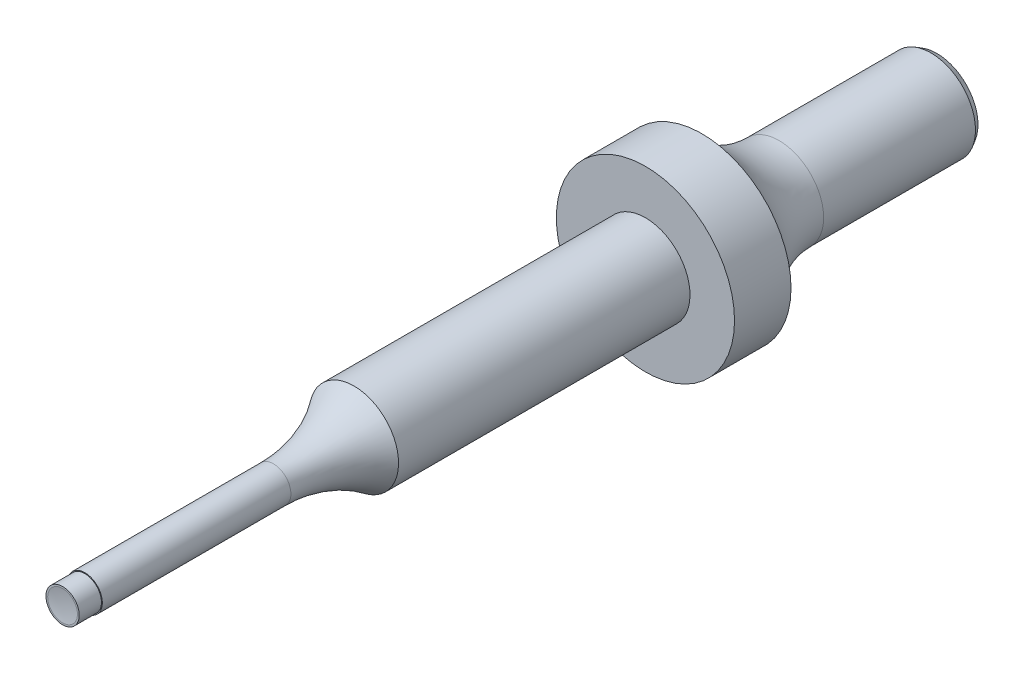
ISO-10303-21;
HEADER;
FILE_DESCRIPTION(('STEP AP214'),'2;1');
FILE_NAME('part.step','',(''),(''),'','','');
FILE_SCHEMA(('AUTOMOTIVE_DESIGN { 1 0 10303 214 1 1 1 1 }'));
ENDSEC;
DATA;
#1=APPLICATION_CONTEXT('core data for automotive mechanical design processes');
#2=APPLICATION_PROTOCOL_DEFINITION('international standard','automotive_design',2000,#1);
#3=PRODUCT_CONTEXT('',#1,'mechanical');
#4=PRODUCT('Part','Part','',(#3));
#5=PRODUCT_RELATED_PRODUCT_CATEGORY('part','',(#4));
#6=PRODUCT_DEFINITION_FORMATION('','',#4);
#7=PRODUCT_DEFINITION_CONTEXT('part definition',#1,'design');
#8=PRODUCT_DEFINITION('design','',#6,#7);
#9=PRODUCT_DEFINITION_SHAPE('','',#8);
#10=(LENGTH_UNIT() NAMED_UNIT(*) SI_UNIT(.MILLI.,.METRE.));
#11=(NAMED_UNIT(*) PLANE_ANGLE_UNIT() SI_UNIT($,.RADIAN.));
#12=(NAMED_UNIT(*) SI_UNIT($,.STERADIAN.) SOLID_ANGLE_UNIT());
#13=UNCERTAINTY_MEASURE_WITH_UNIT(LENGTH_MEASURE(1.E-05),#10,'distance_accuracy_value','');
#14=(GEOMETRIC_REPRESENTATION_CONTEXT(3) GLOBAL_UNCERTAINTY_ASSIGNED_CONTEXT((#13)) GLOBAL_UNIT_ASSIGNED_CONTEXT((#10,
#11,#12)) REPRESENTATION_CONTEXT('',''));
#15=CARTESIAN_POINT('',(0.,0.,0.));
#16=DIRECTION('',(0.,0.,1.));
#17=DIRECTION('',(1.,0.,0.));
#18=AXIS2_PLACEMENT_3D('',#15,#16,#17);
#19=CARTESIAN_POINT('',(0.,0.,-100.));
#20=DIRECTION('',(0.,0.,1.));
#21=DIRECTION('',(1.,0.,0.));
#22=AXIS2_PLACEMENT_3D('',#19,#20,#21);
#23=CYLINDRICAL_SURFACE('',#22,5.095);
#24=CARTESIAN_POINT('',(0.,0.,-33.3333333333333));
#25=DIRECTION('',(0.,0.,-1.));
#26=DIRECTION('',(0.,1.,0.));
#27=AXIS2_PLACEMENT_3D('',#24,#25,#26);
#28=CIRCLE('',#27,5.095);
#29=CARTESIAN_POINT('',(0.,5.095,-33.3333333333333));
#30=VERTEX_POINT('',#29);
#31=EDGE_CURVE('E77',#30,#30,#28,.T.);
#32=ORIENTED_EDGE('',*,*,#31,.T.);
#33=EDGE_LOOP('',(#32));
#34=FACE_BOUND('',#33,.T.);
#35=CARTESIAN_POINT('',(0.,0.,-66.6666666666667));
#36=DIRECTION('',(0.,0.,-1.));
#37=DIRECTION('',(-1.,0.,0.));
#38=AXIS2_PLACEMENT_3D('',#35,#36,#37);
#39=CIRCLE('',#38,5.095);
#40=CARTESIAN_POINT('',(-5.095,0.,-66.6666666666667));
#41=VERTEX_POINT('',#40);
#42=EDGE_CURVE('E44',#41,#41,#39,.F.);
#43=ORIENTED_EDGE('',*,*,#42,.T.);
#44=EDGE_LOOP('',(#43));
#45=FACE_BOUND('',#44,.T.);
#46=ADVANCED_FACE('F40',(#34,#45),#23,.T.);
#47=CARTESIAN_POINT('',(0.,0.,-33.3333333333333));
#48=DIRECTION('',(0.,0.,1.));
#49=DIRECTION('',(1.,0.,0.));
#50=AXIS2_PLACEMENT_3D('',#47,#48,#49);
#51=CYLINDRICAL_SURFACE('',#50,2.);
#52=CARTESIAN_POINT('',(0.,0.,-24.1118841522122));
#53=DIRECTION('',(0.,0.,1.));
#54=DIRECTION('',(0.,-1.,0.));
#55=AXIS2_PLACEMENT_3D('',#52,#53,#54);
#56=CIRCLE('',#55,2.);
#57=CARTESIAN_POINT('',(0.,-2.,-24.1118841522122));
#58=VERTEX_POINT('',#57);
#59=EDGE_CURVE('E12',#58,#58,#56,.F.);
#60=ORIENTED_EDGE('',*,*,#59,.F.);
#61=EDGE_LOOP('',(#60));
#62=FACE_BOUND('',#61,.T.);
#63=CARTESIAN_POINT('',(0.,0.,-2.5475));
#64=DIRECTION('',(0.,0.,1.));
#65=DIRECTION('',(1.,0.,0.));
#66=AXIS2_PLACEMENT_3D('',#63,#64,#65);
#67=CIRCLE('',#66,2.);
#68=CARTESIAN_POINT('',(2.,0.,-2.5475));
#69=VERTEX_POINT('',#68);
#70=EDGE_CURVE('E62',#69,#69,#67,.F.);
#71=ORIENTED_EDGE('',*,*,#70,.T.);
#72=EDGE_LOOP('',(#71));
#73=FACE_BOUND('',#72,.T.);
#74=ADVANCED_FACE('F106',(#62,#73),#51,.T.);
#75=CARTESIAN_POINT('',(0.,0.,-2.5475));
#76=DIRECTION('',(0.,0.,1.));
#77=DIRECTION('',(1.,0.,0.));
#78=AXIS2_PLACEMENT_3D('',#75,#76,#77);
#79=PLANE('',#78);
#80=ORIENTED_EDGE('',*,*,#70,.F.);
#81=EDGE_LOOP('',(#80));
#82=FACE_BOUND('',#81,.T.);
#83=CARTESIAN_POINT('',(0.,0.,-2.5475));
#84=DIRECTION('',(0.,0.,1.));
#85=DIRECTION('',(1.,0.,0.));
#86=AXIS2_PLACEMENT_3D('',#83,#84,#85);
#87=CIRCLE('',#86,1.9);
#88=CARTESIAN_POINT('',(1.9,0.,-2.5475));
#89=VERTEX_POINT('',#88);
#90=EDGE_CURVE('E66',#89,#89,#87,.T.);
#91=ORIENTED_EDGE('',*,*,#90,.F.);
#92=EDGE_LOOP('',(#91));
#93=FACE_BOUND('',#92,.T.);
#94=ADVANCED_FACE('F111',(#82,#93),#79,.T.);
#95=CARTESIAN_POINT('',(0.,0.,-2.5475));
#96=DIRECTION('',(0.,0.,1.));
#97=DIRECTION('',(1.,0.,0.));
#98=AXIS2_PLACEMENT_3D('',#95,#96,#97);
#99=CYLINDRICAL_SURFACE('',#98,1.9);
#100=CARTESIAN_POINT('',(0.,0.,0.));
#101=DIRECTION('',(0.,0.,1.));
#102=DIRECTION('',(1.,0.,0.));
#103=AXIS2_PLACEMENT_3D('',#100,#101,#102);
#104=CIRCLE('',#103,1.9);
#105=CARTESIAN_POINT('',(1.9,0.,0.));
#106=VERTEX_POINT('',#105);
#107=EDGE_CURVE('E67',#106,#106,#104,.T.);
#108=CARTESIAN_POINT('',(1.9,0.,-2.5475));
#109=CARTESIAN_POINT('',(1.9,0.,-2.52096354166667));
#110=CARTESIAN_POINT('',(1.9,0.,-2.49442708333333));
#111=CARTESIAN_POINT('',(1.9,0.,-2.44135416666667));
#112=CARTESIAN_POINT('',(1.9,0.,-2.41481770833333));
#113=CARTESIAN_POINT('',(1.9,0.,-2.36174479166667));
#114=CARTESIAN_POINT('',(1.9,0.,-2.33520833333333));
#115=CARTESIAN_POINT('',(1.9,0.,-2.28213541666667));
#116=CARTESIAN_POINT('',(1.9,0.,-2.25559895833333));
#117=CARTESIAN_POINT('',(1.9,0.,-2.20252604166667));
#118=CARTESIAN_POINT('',(1.9,0.,-2.17598958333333));
#119=CARTESIAN_POINT('',(1.9,0.,-2.12291666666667));
#120=CARTESIAN_POINT('',(1.9,0.,-2.09638020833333));
#121=CARTESIAN_POINT('',(1.9,0.,-2.04330729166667));
#122=CARTESIAN_POINT('',(1.9,0.,-2.01677083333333));
#123=CARTESIAN_POINT('',(1.9,0.,-1.96369791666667));
#124=CARTESIAN_POINT('',(1.9,0.,-1.93716145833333));
#125=CARTESIAN_POINT('',(1.9,0.,-1.88408854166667));
#126=CARTESIAN_POINT('',(1.9,0.,-1.85755208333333));
#127=CARTESIAN_POINT('',(1.9,0.,-1.80447916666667));
#128=CARTESIAN_POINT('',(1.9,0.,-1.77794270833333));
#129=CARTESIAN_POINT('',(1.9,0.,-1.72486979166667));
#130=CARTESIAN_POINT('',(1.9,0.,-1.69833333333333));
#131=CARTESIAN_POINT('',(1.9,0.,-1.64526041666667));
#132=CARTESIAN_POINT('',(1.9,0.,-1.61872395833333));
#133=CARTESIAN_POINT('',(1.9,0.,-1.56565104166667));
#134=CARTESIAN_POINT('',(1.9,0.,-1.53911458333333));
#135=CARTESIAN_POINT('',(1.9,0.,-1.48604166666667));
#136=CARTESIAN_POINT('',(1.9,0.,-1.45950520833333));
#137=CARTESIAN_POINT('',(1.9,0.,-1.40643229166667));
#138=CARTESIAN_POINT('',(1.9,0.,-1.37989583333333));
#139=CARTESIAN_POINT('',(1.9,0.,-1.32682291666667));
#140=CARTESIAN_POINT('',(1.9,0.,-1.30028645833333));
#141=CARTESIAN_POINT('',(1.9,0.,-1.24721354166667));
#142=CARTESIAN_POINT('',(1.9,0.,-1.22067708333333));
#143=CARTESIAN_POINT('',(1.9,0.,-1.16760416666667));
#144=CARTESIAN_POINT('',(1.9,0.,-1.14106770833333));
#145=CARTESIAN_POINT('',(1.9,0.,-1.08799479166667));
#146=CARTESIAN_POINT('',(1.9,0.,-1.06145833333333));
#147=CARTESIAN_POINT('',(1.9,0.,-1.00838541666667));
#148=CARTESIAN_POINT('',(1.9,0.,-0.981848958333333));
#149=CARTESIAN_POINT('',(1.9,0.,-0.928776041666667));
#150=CARTESIAN_POINT('',(1.9,0.,-0.902239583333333));
#151=CARTESIAN_POINT('',(1.9,0.,-0.849166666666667));
#152=CARTESIAN_POINT('',(1.9,0.,-0.822630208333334));
#153=CARTESIAN_POINT('',(1.9,0.,-0.769557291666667));
#154=CARTESIAN_POINT('',(1.9,0.,-0.743020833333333));
#155=CARTESIAN_POINT('',(1.9,0.,-0.689947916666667));
#156=CARTESIAN_POINT('',(1.9,0.,-0.663411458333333));
#157=CARTESIAN_POINT('',(1.9,0.,-0.610338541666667));
#158=CARTESIAN_POINT('',(1.9,0.,-0.583802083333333));
#159=CARTESIAN_POINT('',(1.9,0.,-0.530729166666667));
#160=CARTESIAN_POINT('',(1.9,0.,-0.504192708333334));
#161=CARTESIAN_POINT('',(1.9,0.,-0.451119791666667));
#162=CARTESIAN_POINT('',(1.9,0.,-0.424583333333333));
#163=CARTESIAN_POINT('',(1.9,0.,-0.371510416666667));
#164=CARTESIAN_POINT('',(1.9,0.,-0.344973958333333));
#165=CARTESIAN_POINT('',(1.9,0.,-0.291901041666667));
#166=CARTESIAN_POINT('',(1.9,0.,-0.265364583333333));
#167=CARTESIAN_POINT('',(1.9,0.,-0.212291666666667));
#168=CARTESIAN_POINT('',(1.9,0.,-0.185755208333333));
#169=CARTESIAN_POINT('',(1.9,0.,-0.132682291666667));
#170=CARTESIAN_POINT('',(1.9,0.,-0.106145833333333));
#171=CARTESIAN_POINT('',(1.9,0.,-0.0530729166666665));
#172=CARTESIAN_POINT('',(1.9,0.,-0.0265364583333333));
#173=CARTESIAN_POINT('',(1.9,0.,0.));
#174=B_SPLINE_CURVE_WITH_KNOTS('',3,(#108,#109,#110,#111,#112,#113,#114,#115,#116,#117,#118,
#119,#120,#121,#122,#123,#124,#125,#126,#127,#128,#129,#130,#131,#132,#133,#134,#135,#136,#137,
#138,#139,#140,#141,#142,#143,#144,#145,#146,#147,#148,#149,#150,#151,#152,#153,#154,#155,#156,
#157,#158,#159,#160,#161,#162,#163,#164,#165,#166,#167,#168,#169,#170,#171,#172,#173),
.UNSPECIFIED.,.F.,.F.,(4,2,2,2,2,2,2,2,2,2,2,2,2,2,2,2,2,2,2,2,2,2,2,2,2,2,2,2,2,2,2,2,4),(0.,
0.0796093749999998,0.15921875,0.238828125,0.3184375,0.398046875,0.47765625,0.557265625,0.636875,
0.716484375,0.79609375,0.875703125,0.9553125,1.034921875,1.11453125,1.194140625,1.27375,
1.353359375,1.43296875,1.512578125,1.5921875,1.671796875,1.75140625,1.831015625,1.910625,
1.990234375,2.06984375,2.149453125,2.2290625,2.308671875,2.38828125,2.467890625,2.5475),.UNSPECIFIED.);
#175=EDGE_CURVE('BSEAM147',#89,#106,#174,.T.);
#176=ORIENTED_EDGE('',*,*,#90,.T.);
#177=ORIENTED_EDGE('',*,*,#107,.F.);
#178=ORIENTED_EDGE('',*,*,#175,.T.);
#179=ORIENTED_EDGE('',*,*,#175,.F.);
#180=EDGE_LOOP('',(#176,#178,#177,#179));
#181=FACE_BOUND('',#180,.T.);
#182=ADVANCED_FACE('F147',(#181),#99,.T.);
#183=CARTESIAN_POINT('',(0.,0.,0.));
#184=DIRECTION('',(0.,0.,1.));
#185=DIRECTION('',(1.,0.,0.));
#186=AXIS2_PLACEMENT_3D('',#183,#184,#185);
#187=PLANE('',#186);
#188=CARTESIAN_POINT('',(0.,0.,0.));
#189=DIRECTION('',(0.,0.,1.));
#190=DIRECTION('',(0.,-1.,0.));
#191=AXIS2_PLACEMENT_3D('',#188,#189,#190);
#192=CIRCLE('',#191,1.7);
#193=CARTESIAN_POINT('',(0.,-1.7,0.));
#194=VERTEX_POINT('',#193);
#195=EDGE_CURVE('E71',#194,#194,#192,.T.);
#196=ORIENTED_EDGE('',*,*,#195,.F.);
#197=EDGE_LOOP('',(#196));
#198=FACE_BOUND('',#197,.T.);
#199=ORIENTED_EDGE('',*,*,#107,.T.);
#200=EDGE_LOOP('',(#199));
#201=FACE_BOUND('',#200,.T.);
#202=ADVANCED_FACE('F145',(#198,#201),#187,.T.);
#203=CARTESIAN_POINT('',(0.,0.,10.0471936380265));
#204=DIRECTION('',(0.,0.,1.));
#205=DIRECTION('',(0.,-1.,0.));
#206=AXIS2_PLACEMENT_3D('',#203,#204,#205);
#207=SPHERICAL_SURFACE('',#206,10.19);
#208=ORIENTED_EDGE('',*,*,#195,.T.);
#209=EDGE_LOOP('',(#208));
#210=FACE_BOUND('',#209,.T.);
#211=ADVANCED_FACE('F142',(#210),#207,.F.);
#212=CARTESIAN_POINT('',(0.,0.,-24.1118841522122));
#213=DIRECTION('',(0.,0.,-1.));
#214=DIRECTION('',(0.,1.,0.));
#215=AXIS2_PLACEMENT_3D('',#212,#213,#214);
#216=TOROIDAL_SURFACE('',#215,17.285,15.285);
#217=ORIENTED_EDGE('',*,*,#59,.T.);
#218=EDGE_LOOP('',(#217));
#219=FACE_BOUND('',#218,.T.);
#220=ORIENTED_EDGE('',*,*,#31,.F.);
#221=EDGE_LOOP('',(#220));
#222=FACE_BOUND('',#221,.T.);
#223=ADVANCED_FACE('F123',(#219,#222),#216,.F.);
#224=CARTESIAN_POINT('',(0.,0.,-66.6666666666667));
#225=DIRECTION('',(0.,0.,-1.));
#226=DIRECTION('',(-1.,0.,0.));
#227=AXIS2_PLACEMENT_3D('',#224,#225,#226);
#228=PLANE('',#227);
#229=ORIENTED_EDGE('',*,*,#42,.F.);
#230=EDGE_LOOP('',(#229));
#231=FACE_BOUND('',#230,.T.);
#232=CARTESIAN_POINT('',(0.,0.,-66.6666666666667));
#233=DIRECTION('',(0.,0.,1.));
#234=DIRECTION('',(1.,0.,0.));
#235=AXIS2_PLACEMENT_3D('',#232,#233,#234);
#236=CIRCLE('',#235,10.19);
#237=CARTESIAN_POINT('',(10.19,0.,-66.6666666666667));
#238=VERTEX_POINT('',#237);
#239=EDGE_CURVE('E81',#238,#238,#236,.T.);
#240=ORIENTED_EDGE('',*,*,#239,.T.);
#241=EDGE_LOOP('',(#240));
#242=FACE_BOUND('',#241,.T.);
#243=ADVANCED_FACE('F119',(#231,#242),#228,.F.);
#244=CARTESIAN_POINT('',(0.,0.,-66.6666666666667));
#245=DIRECTION('',(0.,0.,1.));
#246=DIRECTION('',(1.,0.,0.));
#247=AXIS2_PLACEMENT_3D('',#244,#245,#246);
#248=CYLINDRICAL_SURFACE('',#247,10.19);
#249=ORIENTED_EDGE('',*,*,#239,.F.);
#250=EDGE_LOOP('',(#249));
#251=FACE_BOUND('',#250,.T.);
#252=CARTESIAN_POINT('',(0.,0.,-73.1268678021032));
#253=DIRECTION('',(0.,0.,1.));
#254=DIRECTION('',(1.,0.,0.));
#255=AXIS2_PLACEMENT_3D('',#252,#253,#254);
#256=CIRCLE('',#255,10.19);
#257=CARTESIAN_POINT('',(10.19,0.,-73.1268678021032));
#258=VERTEX_POINT('',#257);
#259=EDGE_CURVE('E84',#258,#258,#256,.T.);
#260=ORIENTED_EDGE('',*,*,#259,.T.);
#261=EDGE_LOOP('',(#260));
#262=FACE_BOUND('',#261,.T.);
#263=ADVANCED_FACE('F122',(#251,#262),#248,.T.);
#264=CARTESIAN_POINT('',(0.,0.,-81.9516666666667));
#265=DIRECTION('',(0.,0.,1.));
#266=DIRECTION('',(1.,0.,0.));
#267=AXIS2_PLACEMENT_3D('',#264,#265,#266);
#268=TOROIDAL_SURFACE('',#267,15.285,10.19);
#269=ORIENTED_EDGE('',*,*,#259,.F.);
#270=EDGE_LOOP('',(#269));
#271=FACE_BOUND('',#270,.T.);
#272=CARTESIAN_POINT('',(0.,0.,-81.9516666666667));
#273=DIRECTION('',(0.,0.,1.));
#274=DIRECTION('',(1.,0.,0.));
#275=AXIS2_PLACEMENT_3D('',#272,#273,#274);
#276=CIRCLE('',#275,5.095);
#277=CARTESIAN_POINT('',(5.095,0.,-81.9516666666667));
#278=VERTEX_POINT('',#277);
#279=EDGE_CURVE('E88',#278,#278,#276,.T.);
#280=ORIENTED_EDGE('',*,*,#279,.T.);
#281=EDGE_LOOP('',(#280));
#282=FACE_BOUND('',#281,.T.);
#283=ADVANCED_FACE('F94',(#271,#282),#268,.F.);
#284=CARTESIAN_POINT('',(0.,0.,-100.));
#285=DIRECTION('',(0.,0.,1.));
#286=DIRECTION('',(1.,0.,0.));
#287=AXIS2_PLACEMENT_3D('',#284,#285,#286);
#288=PLANE('',#287);
#289=CARTESIAN_POINT('',(0.,0.,-100.));
#290=DIRECTION('',(0.,0.,1.));
#291=DIRECTION('',(1.,0.,0.));
#292=AXIS2_PLACEMENT_3D('',#289,#290,#291);
#293=CIRCLE('',#292,4.70278671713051);
#294=CARTESIAN_POINT('',(4.70278671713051,0.,-100.));
#295=VERTEX_POINT('',#294);
#296=EDGE_CURVE('E49',#295,#295,#293,.F.);
#297=ORIENTED_EDGE('',*,*,#296,.T.);
#298=EDGE_LOOP('',(#297));
#299=FACE_BOUND('',#298,.T.);
#300=ADVANCED_FACE('F102',(#299),#288,.F.);
#301=CARTESIAN_POINT('',(0.,0.,-99.3206666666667));
#302=DIRECTION('',(0.,0.,1.));
#303=DIRECTION('',(1.,0.,0.));
#304=AXIS2_PLACEMENT_3D('',#301,#302,#303);
#305=CONICAL_SURFACE('',#304,5.095,0.523598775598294);
#306=ORIENTED_EDGE('',*,*,#296,.F.);
#307=EDGE_LOOP('',(#306));
#308=FACE_BOUND('',#307,.T.);
#309=CARTESIAN_POINT('',(0.,0.,-99.3206666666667));
#310=DIRECTION('',(0.,0.,1.));
#311=DIRECTION('',(1.,0.,0.));
#312=AXIS2_PLACEMENT_3D('',#309,#310,#311);
#313=CIRCLE('',#312,5.095);
#314=CARTESIAN_POINT('',(5.095,0.,-99.3206666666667));
#315=VERTEX_POINT('',#314);
#316=EDGE_CURVE('E56',#315,#315,#313,.T.);
#317=ORIENTED_EDGE('',*,*,#316,.F.);
#318=EDGE_LOOP('',(#317));
#319=FACE_BOUND('',#318,.T.);
#320=ADVANCED_FACE('F42',(#308,#319),#305,.T.);
#321=ORIENTED_EDGE('',*,*,#316,.T.);
#322=EDGE_LOOP('',(#321));
#323=FACE_BOUND('',#322,.T.);
#324=ORIENTED_EDGE('',*,*,#279,.F.);
#325=EDGE_LOOP('',(#324));
#326=FACE_BOUND('',#325,.T.);
#327=ADVANCED_FACE('F96',(#323,#326),#23,.T.);
#328=CLOSED_SHELL('',(#46,#74,#94,#182,#202,#211,#223,#243,#263,#283,#300,#320,#327));
#329=MANIFOLD_SOLID_BREP('B2',#328);
#330=ADVANCED_BREP_SHAPE_REPRESENTATION('',(#18,#329),#14);
#331=SHAPE_DEFINITION_REPRESENTATION(#9,#330);
ENDSEC;
END-ISO-10303-21;
